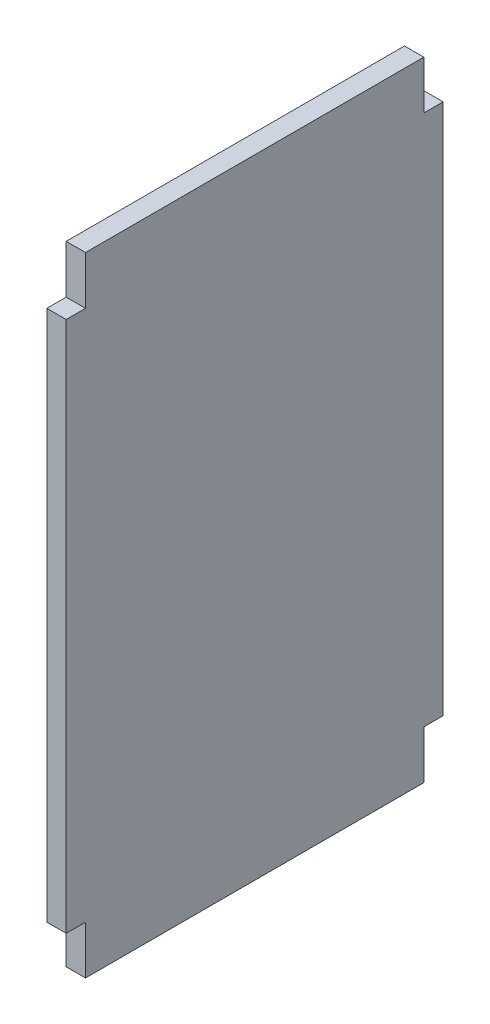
ISO-10303-21;
HEADER;
FILE_DESCRIPTION(('STEP AP214'),'2;1');
FILE_NAME('part.step','',(''),(''),'','','');
FILE_SCHEMA(('AUTOMOTIVE_DESIGN { 1 0 10303 214 1 1 1 1 }'));
ENDSEC;
DATA;
#1=APPLICATION_CONTEXT('core data for automotive mechanical design processes');
#2=APPLICATION_PROTOCOL_DEFINITION('international standard','automotive_design',2000,#1);
#3=PRODUCT_CONTEXT('',#1,'mechanical');
#4=PRODUCT('Part','Part','',(#3));
#5=PRODUCT_RELATED_PRODUCT_CATEGORY('part','',(#4));
#6=PRODUCT_DEFINITION_FORMATION('','',#4);
#7=PRODUCT_DEFINITION_CONTEXT('part definition',#1,'design');
#8=PRODUCT_DEFINITION('design','',#6,#7);
#9=PRODUCT_DEFINITION_SHAPE('','',#8);
#10=(LENGTH_UNIT() NAMED_UNIT(*) SI_UNIT(.MILLI.,.METRE.));
#11=(NAMED_UNIT(*) PLANE_ANGLE_UNIT() SI_UNIT($,.RADIAN.));
#12=(NAMED_UNIT(*) SI_UNIT($,.STERADIAN.) SOLID_ANGLE_UNIT());
#13=UNCERTAINTY_MEASURE_WITH_UNIT(LENGTH_MEASURE(1.E-05),#10,'distance_accuracy_value','');
#14=(GEOMETRIC_REPRESENTATION_CONTEXT(3) GLOBAL_UNCERTAINTY_ASSIGNED_CONTEXT((#13)) GLOBAL_UNIT_ASSIGNED_CONTEXT((#10,
#11,#12)) REPRESENTATION_CONTEXT('',''));
#15=CARTESIAN_POINT('',(0.,0.,0.));
#16=DIRECTION('',(0.,0.,1.));
#17=DIRECTION('',(1.,0.,0.));
#18=AXIS2_PLACEMENT_3D('',#15,#16,#17);
#19=CARTESIAN_POINT('',(2.,0.,0.));
#20=DIRECTION('',(0.,1.,0.));
#21=DIRECTION('',(0.,0.,1.));
#22=AXIS2_PLACEMENT_3D('',#19,#20,#21);
#23=PLANE('',#22);
#24=DIRECTION('',(0.,0.,-1.));
#25=VECTOR('',#24,1.);
#26=CARTESIAN_POINT('',(0.,0.,0.));
#27=LINE('',#26,#25);
#28=CARTESIAN_POINT('',(0.,0.,0.));
#29=VERTEX_POINT('',#28);
#30=CARTESIAN_POINT('',(0.,0.,-35.));
#31=VERTEX_POINT('',#30);
#32=EDGE_CURVE('E158',#29,#31,#27,.T.);
#33=ORIENTED_EDGE('',*,*,#32,.T.);
#34=DIRECTION('',(-1.,0.,0.));
#35=VECTOR('',#34,1.);
#36=CARTESIAN_POINT('',(2.,0.,-35.));
#37=LINE('',#36,#35);
#38=CARTESIAN_POINT('',(2.,0.,-35.));
#39=VERTEX_POINT('',#38);
#40=EDGE_CURVE('E11',#39,#31,#37,.T.);
#41=ORIENTED_EDGE('',*,*,#40,.F.);
#42=DIRECTION('',(0.,0.,-1.));
#43=VECTOR('',#42,1.);
#44=CARTESIAN_POINT('',(2.,0.,0.));
#45=LINE('',#44,#43);
#46=CARTESIAN_POINT('',(2.,0.,0.));
#47=VERTEX_POINT('',#46);
#48=EDGE_CURVE('E259',#47,#39,#45,.T.);
#49=ORIENTED_EDGE('',*,*,#48,.F.);
#50=DIRECTION('',(-1.,0.,0.));
#51=VECTOR('',#50,1.);
#52=CARTESIAN_POINT('',(2.,0.,0.));
#53=LINE('',#52,#51);
#54=EDGE_CURVE('E51',#47,#29,#53,.T.);
#55=ORIENTED_EDGE('',*,*,#54,.T.);
#56=EDGE_LOOP('',(#33,#41,#49,#55));
#57=FACE_BOUND('',#56,.T.);
#58=ADVANCED_FACE('F35',(#57),#23,.F.);
#59=CARTESIAN_POINT('',(2.,0.,-35.));
#60=DIRECTION('',(0.,0.,1.));
#61=DIRECTION('',(1.,0.,0.));
#62=AXIS2_PLACEMENT_3D('',#59,#60,#61);
#63=PLANE('',#62);
#64=DIRECTION('',(0.,1.,0.));
#65=VECTOR('',#64,1.);
#66=CARTESIAN_POINT('',(0.,0.,-35.));
#67=LINE('',#66,#65);
#68=CARTESIAN_POINT('',(0.,5.,-35.));
#69=VERTEX_POINT('',#68);
#70=EDGE_CURVE('E160',#31,#69,#67,.T.);
#71=ORIENTED_EDGE('',*,*,#70,.T.);
#72=DIRECTION('',(-1.,0.,0.));
#73=VECTOR('',#72,1.);
#74=CARTESIAN_POINT('',(2.,5.,-35.));
#75=LINE('',#74,#73);
#76=CARTESIAN_POINT('',(2.,5.,-35.));
#77=VERTEX_POINT('',#76);
#78=EDGE_CURVE('E43',#77,#69,#75,.T.);
#79=ORIENTED_EDGE('',*,*,#78,.F.);
#80=DIRECTION('',(0.,1.,0.));
#81=VECTOR('',#80,1.);
#82=CARTESIAN_POINT('',(2.,0.,-35.));
#83=LINE('',#82,#81);
#84=EDGE_CURVE('E101',#39,#77,#83,.T.);
#85=ORIENTED_EDGE('',*,*,#84,.F.);
#86=ORIENTED_EDGE('',*,*,#40,.T.);
#87=EDGE_LOOP('',(#71,#79,#85,#86));
#88=FACE_BOUND('',#87,.T.);
#89=ADVANCED_FACE('F251',(#88),#63,.F.);
#90=CARTESIAN_POINT('',(2.,4.99999999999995,0.));
#91=DIRECTION('',(0.,1.,0.));
#92=DIRECTION('',(0.,0.,1.));
#93=AXIS2_PLACEMENT_3D('',#90,#91,#92);
#94=PLANE('',#93);
#95=DIRECTION('',(0.,0.,-1.));
#96=VECTOR('',#95,1.);
#97=CARTESIAN_POINT('',(0.,4.99999999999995,0.));
#98=LINE('',#97,#96);
#99=CARTESIAN_POINT('',(0.,5.,-37.));
#100=VERTEX_POINT('',#99);
#101=EDGE_CURVE('E162',#69,#100,#98,.T.);
#102=ORIENTED_EDGE('',*,*,#101,.T.);
#103=DIRECTION('',(-1.,0.,0.));
#104=VECTOR('',#103,1.);
#105=CARTESIAN_POINT('',(2.,5.,-37.));
#106=LINE('',#105,#104);
#107=CARTESIAN_POINT('',(2.,5.,-37.));
#108=VERTEX_POINT('',#107);
#109=EDGE_CURVE('E197',#108,#100,#106,.T.);
#110=ORIENTED_EDGE('',*,*,#109,.F.);
#111=DIRECTION('',(0.,0.,-1.));
#112=VECTOR('',#111,1.);
#113=CARTESIAN_POINT('',(2.,4.99999999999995,0.));
#114=LINE('',#113,#112);
#115=EDGE_CURVE('E204',#77,#108,#114,.T.);
#116=ORIENTED_EDGE('',*,*,#115,.F.);
#117=ORIENTED_EDGE('',*,*,#78,.T.);
#118=EDGE_LOOP('',(#102,#110,#116,#117));
#119=FACE_BOUND('',#118,.T.);
#120=ADVANCED_FACE('F202',(#119),#94,.F.);
#121=CARTESIAN_POINT('',(2.,0.,-37.));
#122=DIRECTION('',(0.,0.,-1.));
#123=DIRECTION('',(-1.,0.,0.));
#124=AXIS2_PLACEMENT_3D('',#121,#122,#123);
#125=PLANE('',#124);
#126=DIRECTION('',(0.,-1.,0.));
#127=VECTOR('',#126,1.);
#128=CARTESIAN_POINT('',(0.,0.,-37.));
#129=LINE('',#128,#127);
#130=CARTESIAN_POINT('',(0.,60.,-37.));
#131=VERTEX_POINT('',#130);
#132=EDGE_CURVE('E166',#131,#100,#129,.T.);
#133=ORIENTED_EDGE('',*,*,#132,.F.);
#134=DIRECTION('',(-1.,0.,0.));
#135=VECTOR('',#134,1.);
#136=CARTESIAN_POINT('',(2.,60.,-37.));
#137=LINE('',#136,#135);
#138=CARTESIAN_POINT('',(2.,60.,-37.));
#139=VERTEX_POINT('',#138);
#140=EDGE_CURVE('E195',#139,#131,#137,.T.);
#141=ORIENTED_EDGE('',*,*,#140,.F.);
#142=DIRECTION('',(0.,-1.,0.));
#143=VECTOR('',#142,1.);
#144=CARTESIAN_POINT('',(2.,0.,-37.));
#145=LINE('',#144,#143);
#146=EDGE_CURVE('E214',#139,#108,#145,.T.);
#147=ORIENTED_EDGE('',*,*,#146,.T.);
#148=ORIENTED_EDGE('',*,*,#109,.T.);
#149=EDGE_LOOP('',(#133,#141,#147,#148));
#150=FACE_BOUND('',#149,.T.);
#151=ADVANCED_FACE('F211',(#150),#125,.T.);
#152=CARTESIAN_POINT('',(2.,60.0000000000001,-2.08166817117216E-13));
#153=DIRECTION('',(0.,1.,0.));
#154=DIRECTION('',(0.,0.,1.));
#155=AXIS2_PLACEMENT_3D('',#152,#153,#154);
#156=PLANE('',#155);
#157=DIRECTION('',(0.,0.,-1.));
#158=VECTOR('',#157,1.);
#159=CARTESIAN_POINT('',(0.,60.0000000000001,-2.08166817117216E-13));
#160=LINE('',#159,#158);
#161=CARTESIAN_POINT('',(0.,60.,-35.));
#162=VERTEX_POINT('',#161);
#163=EDGE_CURVE('E169',#162,#131,#160,.T.);
#164=ORIENTED_EDGE('',*,*,#163,.F.);
#165=DIRECTION('',(-1.,0.,0.));
#166=VECTOR('',#165,1.);
#167=CARTESIAN_POINT('',(2.,60.,-35.));
#168=LINE('',#167,#166);
#169=CARTESIAN_POINT('',(2.,60.,-35.));
#170=VERTEX_POINT('',#169);
#171=EDGE_CURVE('E193',#170,#162,#168,.T.);
#172=ORIENTED_EDGE('',*,*,#171,.F.);
#173=DIRECTION('',(0.,0.,-1.));
#174=VECTOR('',#173,1.);
#175=CARTESIAN_POINT('',(2.,60.0000000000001,-2.08166817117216E-13));
#176=LINE('',#175,#174);
#177=EDGE_CURVE('E217',#170,#139,#176,.T.);
#178=ORIENTED_EDGE('',*,*,#177,.T.);
#179=ORIENTED_EDGE('',*,*,#140,.T.);
#180=EDGE_LOOP('',(#164,#172,#178,#179));
#181=FACE_BOUND('',#180,.T.);
#182=ADVANCED_FACE('F323',(#181),#156,.T.);
#183=CARTESIAN_POINT('',(0.,65.,-35.));
#184=VERTEX_POINT('',#183);
#185=EDGE_CURVE('E163',#162,#184,#67,.T.);
#186=ORIENTED_EDGE('',*,*,#185,.T.);
#187=DIRECTION('',(-1.,0.,0.));
#188=VECTOR('',#187,1.);
#189=CARTESIAN_POINT('',(2.,65.,-35.));
#190=LINE('',#189,#188);
#191=CARTESIAN_POINT('',(2.,65.,-35.));
#192=VERTEX_POINT('',#191);
#193=EDGE_CURVE('E191',#192,#184,#190,.T.);
#194=ORIENTED_EDGE('',*,*,#193,.F.);
#195=EDGE_CURVE('E219',#170,#192,#83,.T.);
#196=ORIENTED_EDGE('',*,*,#195,.F.);
#197=ORIENTED_EDGE('',*,*,#171,.T.);
#198=EDGE_LOOP('',(#186,#194,#196,#197));
#199=FACE_BOUND('',#198,.T.);
#200=ADVANCED_FACE('F256',(#199),#63,.F.);
#201=CARTESIAN_POINT('',(2.,65.,0.));
#202=DIRECTION('',(0.,1.,0.));
#203=DIRECTION('',(0.,0.,1.));
#204=AXIS2_PLACEMENT_3D('',#201,#202,#203);
#205=PLANE('',#204);
#206=DIRECTION('',(0.,0.,-1.));
#207=VECTOR('',#206,1.);
#208=CARTESIAN_POINT('',(0.,65.,0.));
#209=LINE('',#208,#207);
#210=CARTESIAN_POINT('',(0.,65.,0.));
#211=VERTEX_POINT('',#210);
#212=EDGE_CURVE('E172',#211,#184,#209,.T.);
#213=ORIENTED_EDGE('',*,*,#212,.F.);
#214=DIRECTION('',(-1.,0.,0.));
#215=VECTOR('',#214,1.);
#216=CARTESIAN_POINT('',(2.,65.,0.));
#217=LINE('',#216,#215);
#218=CARTESIAN_POINT('',(2.,65.,0.));
#219=VERTEX_POINT('',#218);
#220=EDGE_CURVE('E189',#219,#211,#217,.T.);
#221=ORIENTED_EDGE('',*,*,#220,.F.);
#222=DIRECTION('',(0.,0.,-1.));
#223=VECTOR('',#222,1.);
#224=CARTESIAN_POINT('',(2.,65.,0.));
#225=LINE('',#224,#223);
#226=EDGE_CURVE('E224',#219,#192,#225,.T.);
#227=ORIENTED_EDGE('',*,*,#226,.T.);
#228=ORIENTED_EDGE('',*,*,#193,.T.);
#229=EDGE_LOOP('',(#213,#221,#227,#228));
#230=FACE_BOUND('',#229,.T.);
#231=ADVANCED_FACE('F235',(#230),#205,.T.);
#232=CARTESIAN_POINT('',(2.,0.,0.));
#233=DIRECTION('',(0.,0.,1.));
#234=DIRECTION('',(1.,0.,0.));
#235=AXIS2_PLACEMENT_3D('',#232,#233,#234);
#236=PLANE('',#235);
#237=DIRECTION('',(0.,1.,0.));
#238=VECTOR('',#237,1.);
#239=CARTESIAN_POINT('',(0.,0.,0.));
#240=LINE('',#239,#238);
#241=CARTESIAN_POINT('',(0.,60.,0.));
#242=VERTEX_POINT('',#241);
#243=EDGE_CURVE('E175',#242,#211,#240,.T.);
#244=ORIENTED_EDGE('',*,*,#243,.F.);
#245=DIRECTION('',(-1.,0.,0.));
#246=VECTOR('',#245,1.);
#247=CARTESIAN_POINT('',(2.,60.,0.));
#248=LINE('',#247,#246);
#249=CARTESIAN_POINT('',(2.,60.,0.));
#250=VERTEX_POINT('',#249);
#251=EDGE_CURVE('E187',#250,#242,#248,.T.);
#252=ORIENTED_EDGE('',*,*,#251,.F.);
#253=DIRECTION('',(0.,1.,0.));
#254=VECTOR('',#253,1.);
#255=CARTESIAN_POINT('',(2.,0.,0.));
#256=LINE('',#255,#254);
#257=EDGE_CURVE('E155',#250,#219,#256,.T.);
#258=ORIENTED_EDGE('',*,*,#257,.T.);
#259=ORIENTED_EDGE('',*,*,#220,.T.);
#260=EDGE_LOOP('',(#244,#252,#258,#259));
#261=FACE_BOUND('',#260,.T.);
#262=ADVANCED_FACE('F229',(#261),#236,.T.);
#263=CARTESIAN_POINT('',(2.,60.,0.));
#264=DIRECTION('',(0.,-1.,0.));
#265=DIRECTION('',(0.,0.,-1.));
#266=AXIS2_PLACEMENT_3D('',#263,#264,#265);
#267=PLANE('',#266);
#268=DIRECTION('',(0.,0.,1.));
#269=VECTOR('',#268,1.);
#270=CARTESIAN_POINT('',(0.,60.,0.));
#271=LINE('',#270,#269);
#272=CARTESIAN_POINT('',(0.,60.,2.));
#273=VERTEX_POINT('',#272);
#274=EDGE_CURVE('E178',#242,#273,#271,.T.);
#275=ORIENTED_EDGE('',*,*,#274,.T.);
#276=DIRECTION('',(-1.,0.,0.));
#277=VECTOR('',#276,1.);
#278=CARTESIAN_POINT('',(2.,60.,2.));
#279=LINE('',#278,#277);
#280=CARTESIAN_POINT('',(2.,60.,2.));
#281=VERTEX_POINT('',#280);
#282=EDGE_CURVE('E149',#281,#273,#279,.T.);
#283=ORIENTED_EDGE('',*,*,#282,.F.);
#284=DIRECTION('',(0.,0.,1.));
#285=VECTOR('',#284,1.);
#286=CARTESIAN_POINT('',(2.,60.,0.));
#287=LINE('',#286,#285);
#288=EDGE_CURVE('E137',#250,#281,#287,.T.);
#289=ORIENTED_EDGE('',*,*,#288,.F.);
#290=ORIENTED_EDGE('',*,*,#251,.T.);
#291=EDGE_LOOP('',(#275,#283,#289,#290));
#292=FACE_BOUND('',#291,.T.);
#293=ADVANCED_FACE('F239',(#292),#267,.F.);
#294=CARTESIAN_POINT('',(2.,0.,1.99999999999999));
#295=DIRECTION('',(0.,0.,-1.));
#296=DIRECTION('',(0.,1.,0.));
#297=AXIS2_PLACEMENT_3D('',#294,#295,#296);
#298=PLANE('',#297);
#299=DIRECTION('',(0.,-1.,0.));
#300=VECTOR('',#299,1.);
#301=CARTESIAN_POINT('',(0.,0.,1.99999999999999));
#302=LINE('',#301,#300);
#303=CARTESIAN_POINT('',(0.,5.,1.99999999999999));
#304=VERTEX_POINT('',#303);
#305=EDGE_CURVE('E146',#273,#304,#302,.T.);
#306=ORIENTED_EDGE('',*,*,#305,.T.);
#307=DIRECTION('',(-1.,0.,0.));
#308=VECTOR('',#307,1.);
#309=CARTESIAN_POINT('',(2.,5.,1.99999999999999));
#310=LINE('',#309,#308);
#311=CARTESIAN_POINT('',(2.,5.,1.99999999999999));
#312=VERTEX_POINT('',#311);
#313=EDGE_CURVE('E143',#312,#304,#310,.T.);
#314=ORIENTED_EDGE('',*,*,#313,.F.);
#315=DIRECTION('',(0.,-1.,0.));
#316=VECTOR('',#315,1.);
#317=CARTESIAN_POINT('',(2.,0.,1.99999999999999));
#318=LINE('',#317,#316);
#319=EDGE_CURVE('E129',#281,#312,#318,.T.);
#320=ORIENTED_EDGE('',*,*,#319,.F.);
#321=ORIENTED_EDGE('',*,*,#282,.T.);
#322=EDGE_LOOP('',(#306,#314,#320,#321));
#323=FACE_BOUND('',#322,.T.);
#324=ADVANCED_FACE('F144',(#323),#298,.F.);
#325=CARTESIAN_POINT('',(2.,5.,0.));
#326=DIRECTION('',(0.,-1.,0.));
#327=DIRECTION('',(0.,0.,-1.));
#328=AXIS2_PLACEMENT_3D('',#325,#326,#327);
#329=PLANE('',#328);
#330=DIRECTION('',(0.,0.,1.));
#331=VECTOR('',#330,1.);
#332=CARTESIAN_POINT('',(0.,5.,0.));
#333=LINE('',#332,#331);
#334=CARTESIAN_POINT('',(0.,5.,0.));
#335=VERTEX_POINT('',#334);
#336=EDGE_CURVE('E182',#335,#304,#333,.T.);
#337=ORIENTED_EDGE('',*,*,#336,.F.);
#338=DIRECTION('',(-1.,0.,0.));
#339=VECTOR('',#338,1.);
#340=CARTESIAN_POINT('',(2.,5.,0.));
#341=LINE('',#340,#339);
#342=CARTESIAN_POINT('',(2.,5.,0.));
#343=VERTEX_POINT('',#342);
#344=EDGE_CURVE('E89',#343,#335,#341,.T.);
#345=ORIENTED_EDGE('',*,*,#344,.F.);
#346=DIRECTION('',(0.,0.,1.));
#347=VECTOR('',#346,1.);
#348=CARTESIAN_POINT('',(2.,5.,0.));
#349=LINE('',#348,#347);
#350=EDGE_CURVE('E134',#343,#312,#349,.T.);
#351=ORIENTED_EDGE('',*,*,#350,.T.);
#352=ORIENTED_EDGE('',*,*,#313,.T.);
#353=EDGE_LOOP('',(#337,#345,#351,#352));
#354=FACE_BOUND('',#353,.T.);
#355=ADVANCED_FACE('F151',(#354),#329,.T.);
#356=EDGE_CURVE('E179',#29,#335,#240,.T.);
#357=ORIENTED_EDGE('',*,*,#356,.F.);
#358=ORIENTED_EDGE('',*,*,#54,.F.);
#359=EDGE_CURVE('E152',#47,#343,#256,.T.);
#360=ORIENTED_EDGE('',*,*,#359,.T.);
#361=ORIENTED_EDGE('',*,*,#344,.T.);
#362=EDGE_LOOP('',(#357,#358,#360,#361));
#363=FACE_BOUND('',#362,.T.);
#364=ADVANCED_FACE('F248',(#363),#236,.T.);
#365=CARTESIAN_POINT('',(2.,0.,0.));
#366=DIRECTION('',(1.,0.,0.));
#367=DIRECTION('',(0.,0.,-1.));
#368=AXIS2_PLACEMENT_3D('',#365,#366,#367);
#369=PLANE('',#368);
#370=ORIENTED_EDGE('',*,*,#48,.T.);
#371=ORIENTED_EDGE('',*,*,#84,.T.);
#372=ORIENTED_EDGE('',*,*,#115,.T.);
#373=ORIENTED_EDGE('',*,*,#146,.F.);
#374=ORIENTED_EDGE('',*,*,#177,.F.);
#375=ORIENTED_EDGE('',*,*,#195,.T.);
#376=ORIENTED_EDGE('',*,*,#226,.F.);
#377=ORIENTED_EDGE('',*,*,#257,.F.);
#378=ORIENTED_EDGE('',*,*,#288,.T.);
#379=ORIENTED_EDGE('',*,*,#319,.T.);
#380=ORIENTED_EDGE('',*,*,#350,.F.);
#381=ORIENTED_EDGE('',*,*,#359,.F.);
#382=EDGE_LOOP('',(#370,#371,#372,#373,#374,#375,#376,#377,#378,#379,#380,#381));
#383=FACE_BOUND('',#382,.T.);
#384=ADVANCED_FACE('F131',(#383),#369,.T.);
#385=CARTESIAN_POINT('',(0.,0.,0.));
#386=DIRECTION('',(1.,0.,0.));
#387=DIRECTION('',(0.,0.,-1.));
#388=AXIS2_PLACEMENT_3D('',#385,#386,#387);
#389=PLANE('',#388);
#390=ORIENTED_EDGE('',*,*,#32,.F.);
#391=ORIENTED_EDGE('',*,*,#356,.T.);
#392=ORIENTED_EDGE('',*,*,#336,.T.);
#393=ORIENTED_EDGE('',*,*,#305,.F.);
#394=ORIENTED_EDGE('',*,*,#274,.F.);
#395=ORIENTED_EDGE('',*,*,#243,.T.);
#396=ORIENTED_EDGE('',*,*,#212,.T.);
#397=ORIENTED_EDGE('',*,*,#185,.F.);
#398=ORIENTED_EDGE('',*,*,#163,.T.);
#399=ORIENTED_EDGE('',*,*,#132,.T.);
#400=ORIENTED_EDGE('',*,*,#101,.F.);
#401=ORIENTED_EDGE('',*,*,#70,.F.);
#402=EDGE_LOOP('',(#390,#391,#392,#393,#394,#395,#396,#397,#398,#399,#400,#401));
#403=FACE_BOUND('',#402,.T.);
#404=ADVANCED_FACE('F206',(#403),#389,.F.);
#405=CLOSED_SHELL('',(#58,#89,#120,#151,#182,#200,#231,#262,#293,#324,#355,#364,#384,#404));
#406=MANIFOLD_SOLID_BREP('B2',#405);
#407=ADVANCED_BREP_SHAPE_REPRESENTATION('',(#18,#406),#14);
#408=SHAPE_DEFINITION_REPRESENTATION(#9,#407);
ENDSEC;
END-ISO-10303-21;
